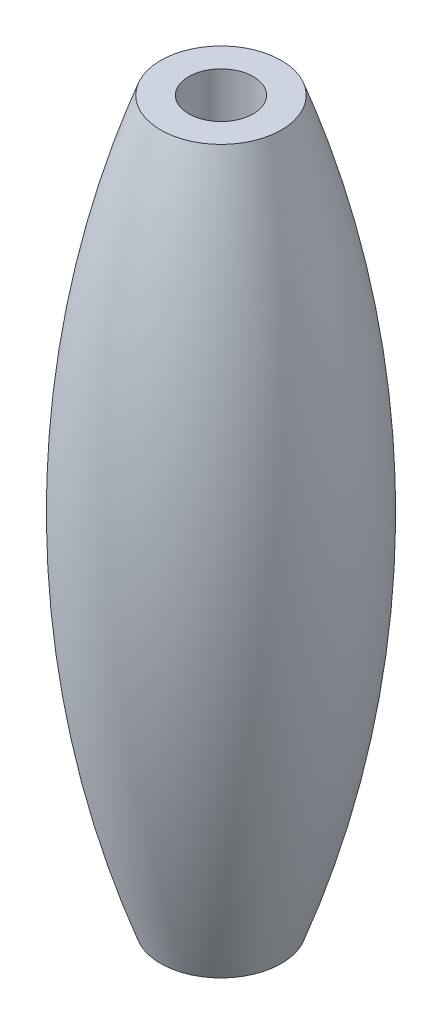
from build123d import *

# Parameters (mm, degrees)
M3_CLEARANCE_HOLE1_D = 3.4


with BuildPart() as part:
    # Sketch1 → Revolve1 (revolve)
    with BuildSketch(Plane.XY, mode=Mode.PRIVATE) as revolve1_sk:
        with BuildLine():
            Line((0, -19), (0, 19))
            Line((0, 19), (3.175, 19))
            ThreePointArc((3.175, 19), (6.5, 0), (3.175, -19))
            Line((3.175, -19), (0, -19))
        make_face()
    revolve(revolve1_sk.sketch.rotate(Axis((0, 0, 0), (0, 1, 0)), 90), axis=Axis((0, 0, 0), (0, 1, 0)))

    # M3 Clearance Hole1 (through all)
    with Locations(Plane(origin=(0, 19, 0), x_dir=(-1, 0, 0), z_dir=(0, 1, 0))):
        with Locations((0, 0)):
            Hole(M3_CLEARANCE_HOLE1_D / 2)


solid = part.part
